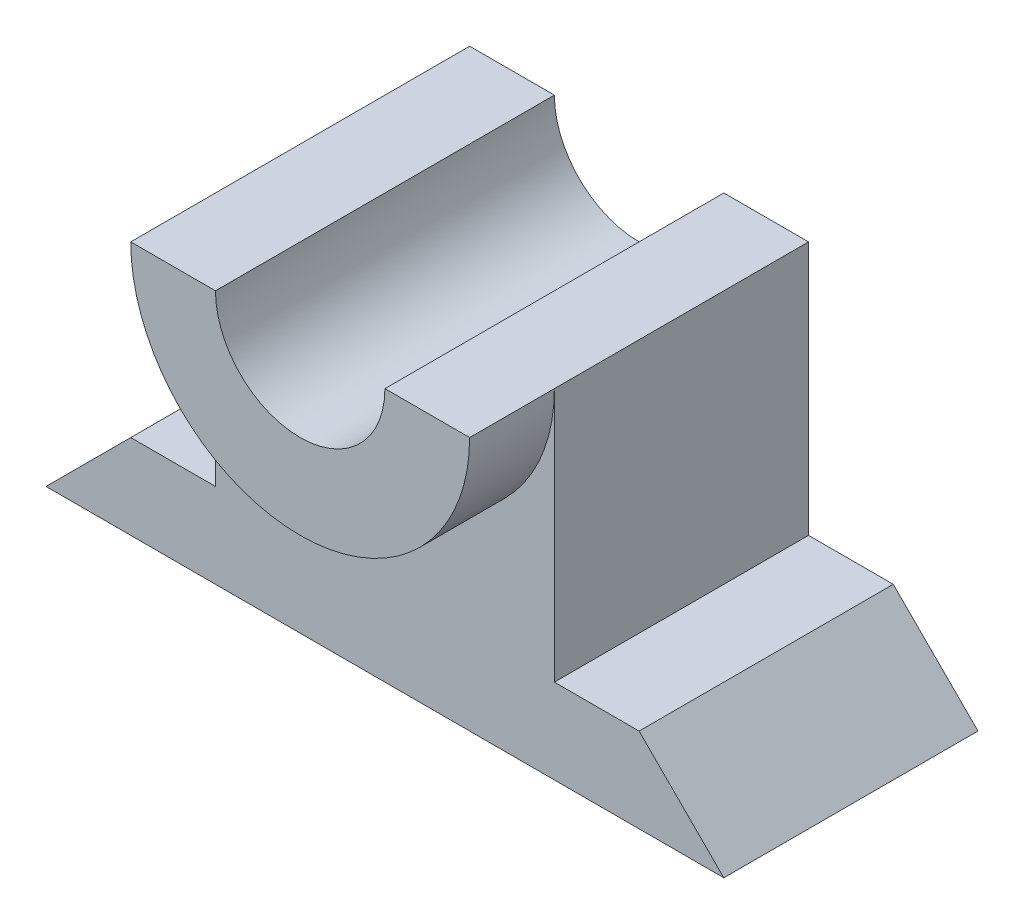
ISO-10303-21;
HEADER;
FILE_DESCRIPTION(('STEP AP214'),'2;1');
FILE_NAME('part.step','',(''),(''),'','','');
FILE_SCHEMA(('AUTOMOTIVE_DESIGN { 1 0 10303 214 1 1 1 1 }'));
ENDSEC;
DATA;
#1=APPLICATION_CONTEXT('core data for automotive mechanical design processes');
#2=APPLICATION_PROTOCOL_DEFINITION('international standard','automotive_design',2000,#1);
#3=PRODUCT_CONTEXT('',#1,'mechanical');
#4=PRODUCT('Part','Part','',(#3));
#5=PRODUCT_RELATED_PRODUCT_CATEGORY('part','',(#4));
#6=PRODUCT_DEFINITION_FORMATION('','',#4);
#7=PRODUCT_DEFINITION_CONTEXT('part definition',#1,'design');
#8=PRODUCT_DEFINITION('design','',#6,#7);
#9=PRODUCT_DEFINITION_SHAPE('','',#8);
#10=(LENGTH_UNIT() NAMED_UNIT(*) SI_UNIT(.MILLI.,.METRE.));
#11=(NAMED_UNIT(*) PLANE_ANGLE_UNIT() SI_UNIT($,.RADIAN.));
#12=(NAMED_UNIT(*) SI_UNIT($,.STERADIAN.) SOLID_ANGLE_UNIT());
#13=UNCERTAINTY_MEASURE_WITH_UNIT(LENGTH_MEASURE(1.E-05),#10,'distance_accuracy_value','');
#14=(GEOMETRIC_REPRESENTATION_CONTEXT(3) GLOBAL_UNCERTAINTY_ASSIGNED_CONTEXT((#13)) GLOBAL_UNIT_ASSIGNED_CONTEXT((#10,
#11,#12)) REPRESENTATION_CONTEXT('',''));
#15=CARTESIAN_POINT('',(0.,0.,0.));
#16=DIRECTION('',(0.,0.,1.));
#17=DIRECTION('',(1.,0.,0.));
#18=AXIS2_PLACEMENT_3D('',#15,#16,#17);
#19=CARTESIAN_POINT('',(-2.04903555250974,-68.0970044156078,30.));
#20=DIRECTION('',(0.,0.,1.));
#21=DIRECTION('',(1.,0.,0.));
#22=AXIS2_PLACEMENT_3D('',#19,#20,#21);
#23=PLANE('',#22);
#24=DIRECTION('',(0.,1.,0.));
#25=VECTOR('',#24,1.);
#26=CARTESIAN_POINT('',(20.,-68.0970044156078,30.));
#27=LINE('',#26,#25);
#28=CARTESIAN_POINT('',(20.,9.99999999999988,30.));
#29=VERTEX_POINT('',#28);
#30=CARTESIAN_POINT('',(20.,40.,30.));
#31=VERTEX_POINT('',#30);
#32=EDGE_CURVE('E96',#29,#31,#27,.T.);
#33=ORIENTED_EDGE('',*,*,#32,.T.);
#34=CARTESIAN_POINT('',(0.,40.,30.));
#35=DIRECTION('',(0.,0.,1.));
#36=DIRECTION('',(1.,0.,0.));
#37=AXIS2_PLACEMENT_3D('',#34,#35,#36);
#38=CIRCLE('',#37,20.);
#39=CARTESIAN_POINT('',(-20.,40.,30.));
#40=VERTEX_POINT('',#39);
#41=EDGE_CURVE('E142',#31,#40,#38,.F.);
#42=ORIENTED_EDGE('',*,*,#41,.T.);
#43=DIRECTION('',(0.,1.,0.));
#44=VECTOR('',#43,1.);
#45=CARTESIAN_POINT('',(-20.,-68.0970044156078,30.));
#46=LINE('',#45,#44);
#47=CARTESIAN_POINT('',(-20.,9.99999999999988,30.));
#48=VERTEX_POINT('',#47);
#49=EDGE_CURVE('E219',#48,#40,#46,.T.);
#50=ORIENTED_EDGE('',*,*,#49,.F.);
#51=DIRECTION('',(1.,0.,0.));
#52=VECTOR('',#51,1.);
#53=CARTESIAN_POINT('',(-2.0490355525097,9.99999999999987,30.));
#54=LINE('',#53,#52);
#55=CARTESIAN_POINT('',(-30.,9.99999999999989,30.));
#56=VERTEX_POINT('',#55);
#57=EDGE_CURVE('E132',#56,#48,#54,.T.);
#58=ORIENTED_EDGE('',*,*,#57,.F.);
#59=DIRECTION('',(0.707106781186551,0.707106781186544,0.));
#60=VECTOR('',#59,1.);
#61=CARTESIAN_POINT('',(-55.0730199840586,-15.0730199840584,30.));
#62=LINE('',#61,#60);
#63=CARTESIAN_POINT('',(-40.,0.,30.));
#64=VERTEX_POINT('',#63);
#65=EDGE_CURVE('E130',#64,#56,#62,.T.);
#66=ORIENTED_EDGE('',*,*,#65,.F.);
#67=DIRECTION('',(-1.,0.,0.));
#68=VECTOR('',#67,1.);
#69=CARTESIAN_POINT('',(-2.04903555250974,0.,30.));
#70=LINE('',#69,#68);
#71=CARTESIAN_POINT('',(40.,0.,30.));
#72=VERTEX_POINT('',#71);
#73=EDGE_CURVE('E118',#72,#64,#70,.T.);
#74=ORIENTED_EDGE('',*,*,#73,.F.);
#75=DIRECTION('',(-0.707106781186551,0.707106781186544,0.));
#76=VECTOR('',#75,1.);
#77=CARTESIAN_POINT('',(53.0239844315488,-13.0239844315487,30.));
#78=LINE('',#77,#76);
#79=CARTESIAN_POINT('',(30.,9.99999999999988,30.));
#80=VERTEX_POINT('',#79);
#81=EDGE_CURVE('E124',#72,#80,#78,.T.);
#82=ORIENTED_EDGE('',*,*,#81,.T.);
#83=DIRECTION('',(-1.,0.,0.));
#84=VECTOR('',#83,1.);
#85=CARTESIAN_POINT('',(-2.04903555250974,9.99999999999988,30.));
#86=LINE('',#85,#84);
#87=EDGE_CURVE('E49',#80,#29,#86,.T.);
#88=ORIENTED_EDGE('',*,*,#87,.T.);
#89=EDGE_LOOP('',(#33,#42,#50,#58,#66,#74,#82,#88));
#90=FACE_BOUND('',#89,.T.);
#91=ADVANCED_FACE('F32',(#90),#23,.T.);
#92=CARTESIAN_POINT('',(20.,-68.0970044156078,30.));
#93=DIRECTION('',(-1.,0.,0.));
#94=DIRECTION('',(0.,0.,1.));
#95=AXIS2_PLACEMENT_3D('',#92,#93,#94);
#96=PLANE('',#95);
#97=DIRECTION('',(0.,1.,0.));
#98=VECTOR('',#97,1.);
#99=CARTESIAN_POINT('',(20.,-68.0970044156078,0.));
#100=LINE('',#99,#98);
#101=CARTESIAN_POINT('',(20.,9.99999999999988,0.));
#102=VERTEX_POINT('',#101);
#103=CARTESIAN_POINT('',(20.,40.,0.));
#104=VERTEX_POINT('',#103);
#105=EDGE_CURVE('E138',#102,#104,#100,.T.);
#106=ORIENTED_EDGE('',*,*,#105,.T.);
#107=DIRECTION('',(0.,0.,-1.));
#108=VECTOR('',#107,1.);
#109=CARTESIAN_POINT('',(20.,40.,30.));
#110=LINE('',#109,#108);
#111=EDGE_CURVE('E11',#31,#104,#110,.T.);
#112=ORIENTED_EDGE('',*,*,#111,.F.);
#113=ORIENTED_EDGE('',*,*,#32,.F.);
#114=DIRECTION('',(0.,0.,-1.));
#115=VECTOR('',#114,1.);
#116=CARTESIAN_POINT('',(20.,9.99999999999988,30.));
#117=LINE('',#116,#115);
#118=EDGE_CURVE('E137',#29,#102,#117,.T.);
#119=ORIENTED_EDGE('',*,*,#118,.T.);
#120=EDGE_LOOP('',(#106,#112,#113,#119));
#121=FACE_BOUND('',#120,.T.);
#122=ADVANCED_FACE('F34',(#121),#96,.F.);
#123=CARTESIAN_POINT('',(-2.04903555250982,40.,30.));
#124=DIRECTION('',(0.,-1.,0.));
#125=DIRECTION('',(1.,0.,0.));
#126=AXIS2_PLACEMENT_3D('',#123,#124,#125);
#127=PLANE('',#126);
#128=DIRECTION('',(-1.,0.,0.));
#129=VECTOR('',#128,1.);
#130=CARTESIAN_POINT('',(-2.04903555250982,40.,0.));
#131=LINE('',#130,#129);
#132=CARTESIAN_POINT('',(10.,40.,0.));
#133=VERTEX_POINT('',#132);
#134=EDGE_CURVE('E141',#104,#133,#131,.T.);
#135=ORIENTED_EDGE('',*,*,#134,.T.);
#136=DIRECTION('',(0.,0.,-1.));
#137=VECTOR('',#136,1.);
#138=CARTESIAN_POINT('',(10.,40.,30.));
#139=LINE('',#138,#137);
#140=CARTESIAN_POINT('',(10.,40.,40.));
#141=VERTEX_POINT('',#140);
#142=EDGE_CURVE('E41',#141,#133,#139,.T.);
#143=ORIENTED_EDGE('',*,*,#142,.F.);
#144=DIRECTION('',(-1.,0.,0.));
#145=VECTOR('',#144,1.);
#146=CARTESIAN_POINT('',(-2.04903555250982,40.,40.));
#147=LINE('',#146,#145);
#148=CARTESIAN_POINT('',(20.,40.,40.));
#149=VERTEX_POINT('',#148);
#150=EDGE_CURVE('E205',#149,#141,#147,.T.);
#151=ORIENTED_EDGE('',*,*,#150,.F.);
#152=DIRECTION('',(0.,0.,-1.));
#153=VECTOR('',#152,1.);
#154=CARTESIAN_POINT('',(20.,40.,40.));
#155=LINE('',#154,#153);
#156=EDGE_CURVE('E212',#149,#31,#155,.T.);
#157=ORIENTED_EDGE('',*,*,#156,.T.);
#158=ORIENTED_EDGE('',*,*,#111,.T.);
#159=EDGE_LOOP('',(#135,#143,#151,#157,#158));
#160=FACE_BOUND('',#159,.T.);
#161=ADVANCED_FACE('F184',(#160),#127,.F.);
#162=CARTESIAN_POINT('',(0.,40.,30.));
#163=DIRECTION('',(0.,0.,-1.));
#164=DIRECTION('',(-1.,0.,0.));
#165=AXIS2_PLACEMENT_3D('',#162,#163,#164);
#166=CYLINDRICAL_SURFACE('',#165,10.);
#167=CARTESIAN_POINT('',(0.,40.,0.));
#168=DIRECTION('',(0.,0.,1.));
#169=DIRECTION('',(1.,0.,0.));
#170=AXIS2_PLACEMENT_3D('',#167,#168,#169);
#171=CIRCLE('',#170,10.);
#172=CARTESIAN_POINT('',(-10.,40.,0.));
#173=VERTEX_POINT('',#172);
#174=EDGE_CURVE('E145',#173,#133,#171,.T.);
#175=ORIENTED_EDGE('',*,*,#174,.F.);
#176=DIRECTION('',(0.,0.,-1.));
#177=VECTOR('',#176,1.);
#178=CARTESIAN_POINT('',(-10.,40.,30.));
#179=LINE('',#178,#177);
#180=CARTESIAN_POINT('',(-10.,40.,40.));
#181=VERTEX_POINT('',#180);
#182=EDGE_CURVE('E172',#181,#173,#179,.T.);
#183=ORIENTED_EDGE('',*,*,#182,.F.);
#184=CARTESIAN_POINT('',(0.,40.,40.));
#185=DIRECTION('',(0.,0.,1.));
#186=DIRECTION('',(1.,0.,0.));
#187=AXIS2_PLACEMENT_3D('',#184,#185,#186);
#188=CIRCLE('',#187,10.);
#189=EDGE_CURVE('E180',#181,#141,#188,.T.);
#190=ORIENTED_EDGE('',*,*,#189,.T.);
#191=ORIENTED_EDGE('',*,*,#142,.T.);
#192=EDGE_LOOP('',(#175,#183,#190,#191));
#193=FACE_BOUND('',#192,.T.);
#194=ADVANCED_FACE('F177',(#193),#166,.F.);
#195=CARTESIAN_POINT('',(-2.04903555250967,40.,30.));
#196=DIRECTION('',(0.,1.,0.));
#197=DIRECTION('',(-1.,0.,0.));
#198=AXIS2_PLACEMENT_3D('',#195,#196,#197);
#199=PLANE('',#198);
#200=DIRECTION('',(1.,0.,0.));
#201=VECTOR('',#200,1.);
#202=CARTESIAN_POINT('',(-2.04903555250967,40.,0.));
#203=LINE('',#202,#201);
#204=CARTESIAN_POINT('',(-20.,40.,0.));
#205=VERTEX_POINT('',#204);
#206=EDGE_CURVE('E148',#205,#173,#203,.T.);
#207=ORIENTED_EDGE('',*,*,#206,.F.);
#208=DIRECTION('',(0.,0.,-1.));
#209=VECTOR('',#208,1.);
#210=CARTESIAN_POINT('',(-20.,40.,30.));
#211=LINE('',#210,#209);
#212=EDGE_CURVE('E170',#40,#205,#211,.T.);
#213=ORIENTED_EDGE('',*,*,#212,.F.);
#214=DIRECTION('',(0.,0.,-1.));
#215=VECTOR('',#214,1.);
#216=CARTESIAN_POINT('',(-20.,40.,40.));
#217=LINE('',#216,#215);
#218=CARTESIAN_POINT('',(-20.,40.,40.));
#219=VERTEX_POINT('',#218);
#220=EDGE_CURVE('E214',#219,#40,#217,.T.);
#221=ORIENTED_EDGE('',*,*,#220,.F.);
#222=DIRECTION('',(1.,0.,0.));
#223=VECTOR('',#222,1.);
#224=CARTESIAN_POINT('',(-2.04903555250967,40.,40.));
#225=LINE('',#224,#223);
#226=EDGE_CURVE('E199',#219,#181,#225,.T.);
#227=ORIENTED_EDGE('',*,*,#226,.T.);
#228=ORIENTED_EDGE('',*,*,#182,.T.);
#229=EDGE_LOOP('',(#207,#213,#221,#227,#228));
#230=FACE_BOUND('',#229,.T.);
#231=ADVANCED_FACE('F193',(#230),#199,.T.);
#232=CARTESIAN_POINT('',(-20.,-68.0970044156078,30.));
#233=DIRECTION('',(-1.,0.,0.));
#234=DIRECTION('',(0.,0.,1.));
#235=AXIS2_PLACEMENT_3D('',#232,#233,#234);
#236=PLANE('',#235);
#237=DIRECTION('',(0.,1.,0.));
#238=VECTOR('',#237,1.);
#239=CARTESIAN_POINT('',(-20.,-68.0970044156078,0.));
#240=LINE('',#239,#238);
#241=CARTESIAN_POINT('',(-20.,9.99999999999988,0.));
#242=VERTEX_POINT('',#241);
#243=EDGE_CURVE('E151',#242,#205,#240,.T.);
#244=ORIENTED_EDGE('',*,*,#243,.F.);
#245=DIRECTION('',(0.,0.,-1.));
#246=VECTOR('',#245,1.);
#247=CARTESIAN_POINT('',(-20.,9.99999999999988,30.));
#248=LINE('',#247,#246);
#249=EDGE_CURVE('E168',#48,#242,#248,.T.);
#250=ORIENTED_EDGE('',*,*,#249,.F.);
#251=ORIENTED_EDGE('',*,*,#49,.T.);
#252=ORIENTED_EDGE('',*,*,#212,.T.);
#253=EDGE_LOOP('',(#244,#250,#251,#252));
#254=FACE_BOUND('',#253,.T.);
#255=ADVANCED_FACE('F267',(#254),#236,.T.);
#256=CARTESIAN_POINT('',(-2.0490355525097,9.99999999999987,30.));
#257=DIRECTION('',(0.,1.,0.));
#258=DIRECTION('',(-1.,0.,0.));
#259=AXIS2_PLACEMENT_3D('',#256,#257,#258);
#260=PLANE('',#259);
#261=DIRECTION('',(1.,0.,0.));
#262=VECTOR('',#261,1.);
#263=CARTESIAN_POINT('',(-2.0490355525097,9.99999999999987,0.));
#264=LINE('',#263,#262);
#265=CARTESIAN_POINT('',(-30.,9.99999999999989,0.));
#266=VERTEX_POINT('',#265);
#267=EDGE_CURVE('E154',#266,#242,#264,.T.);
#268=ORIENTED_EDGE('',*,*,#267,.F.);
#269=DIRECTION('',(0.,0.,-1.));
#270=VECTOR('',#269,1.);
#271=CARTESIAN_POINT('',(-30.,9.99999999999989,30.));
#272=LINE('',#271,#270);
#273=EDGE_CURVE('E166',#56,#266,#272,.T.);
#274=ORIENTED_EDGE('',*,*,#273,.F.);
#275=ORIENTED_EDGE('',*,*,#57,.T.);
#276=ORIENTED_EDGE('',*,*,#249,.T.);
#277=EDGE_LOOP('',(#268,#274,#275,#276));
#278=FACE_BOUND('',#277,.T.);
#279=ADVANCED_FACE('F223',(#278),#260,.T.);
#280=CARTESIAN_POINT('',(-55.0730199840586,-15.0730199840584,30.));
#281=DIRECTION('',(-0.707106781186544,0.707106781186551,0.));
#282=DIRECTION('',(-0.707106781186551,-0.707106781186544,0.));
#283=AXIS2_PLACEMENT_3D('',#280,#281,#282);
#284=PLANE('',#283);
#285=DIRECTION('',(0.707106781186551,0.707106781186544,0.));
#286=VECTOR('',#285,1.);
#287=CARTESIAN_POINT('',(-55.0730199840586,-15.0730199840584,0.));
#288=LINE('',#287,#286);
#289=CARTESIAN_POINT('',(-40.,0.,0.));
#290=VERTEX_POINT('',#289);
#291=EDGE_CURVE('E157',#290,#266,#288,.T.);
#292=ORIENTED_EDGE('',*,*,#291,.F.);
#293=DIRECTION('',(0.,0.,-1.));
#294=VECTOR('',#293,1.);
#295=CARTESIAN_POINT('',(-40.,0.,30.));
#296=LINE('',#295,#294);
#297=EDGE_CURVE('E121',#64,#290,#296,.T.);
#298=ORIENTED_EDGE('',*,*,#297,.F.);
#299=ORIENTED_EDGE('',*,*,#65,.T.);
#300=ORIENTED_EDGE('',*,*,#273,.T.);
#301=EDGE_LOOP('',(#292,#298,#299,#300));
#302=FACE_BOUND('',#301,.T.);
#303=ADVANCED_FACE('F227',(#302),#284,.T.);
#304=CARTESIAN_POINT('',(-2.04903555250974,0.,30.));
#305=DIRECTION('',(0.,-1.,0.));
#306=DIRECTION('',(0.,0.,-1.));
#307=AXIS2_PLACEMENT_3D('',#304,#305,#306);
#308=PLANE('',#307);
#309=DIRECTION('',(-1.,0.,0.));
#310=VECTOR('',#309,1.);
#311=CARTESIAN_POINT('',(-2.04903555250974,0.,0.));
#312=LINE('',#311,#310);
#313=CARTESIAN_POINT('',(40.,0.,0.));
#314=VERTEX_POINT('',#313);
#315=EDGE_CURVE('E120',#314,#290,#312,.T.);
#316=ORIENTED_EDGE('',*,*,#315,.F.);
#317=DIRECTION('',(0.,0.,-1.));
#318=VECTOR('',#317,1.);
#319=CARTESIAN_POINT('',(40.,0.,30.));
#320=LINE('',#319,#318);
#321=EDGE_CURVE('E114',#72,#314,#320,.T.);
#322=ORIENTED_EDGE('',*,*,#321,.F.);
#323=ORIENTED_EDGE('',*,*,#73,.T.);
#324=ORIENTED_EDGE('',*,*,#297,.T.);
#325=EDGE_LOOP('',(#316,#322,#323,#324));
#326=FACE_BOUND('',#325,.T.);
#327=ADVANCED_FACE('F116',(#326),#308,.T.);
#328=CARTESIAN_POINT('',(53.0239844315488,-13.0239844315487,30.));
#329=DIRECTION('',(-0.707106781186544,-0.707106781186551,0.));
#330=DIRECTION('',(0.707106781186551,-0.707106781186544,0.));
#331=AXIS2_PLACEMENT_3D('',#328,#329,#330);
#332=PLANE('',#331);
#333=DIRECTION('',(-0.707106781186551,0.707106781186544,0.));
#334=VECTOR('',#333,1.);
#335=CARTESIAN_POINT('',(53.0239844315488,-13.0239844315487,0.));
#336=LINE('',#335,#334);
#337=CARTESIAN_POINT('',(30.,9.99999999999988,0.));
#338=VERTEX_POINT('',#337);
#339=EDGE_CURVE('E84',#314,#338,#336,.T.);
#340=ORIENTED_EDGE('',*,*,#339,.T.);
#341=DIRECTION('',(0.,0.,-1.));
#342=VECTOR('',#341,1.);
#343=CARTESIAN_POINT('',(30.,9.99999999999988,30.));
#344=LINE('',#343,#342);
#345=EDGE_CURVE('E122',#80,#338,#344,.T.);
#346=ORIENTED_EDGE('',*,*,#345,.F.);
#347=ORIENTED_EDGE('',*,*,#81,.F.);
#348=ORIENTED_EDGE('',*,*,#321,.T.);
#349=EDGE_LOOP('',(#340,#346,#347,#348));
#350=FACE_BOUND('',#349,.T.);
#351=ADVANCED_FACE('F125',(#350),#332,.F.);
#352=CARTESIAN_POINT('',(-2.04903555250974,9.99999999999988,30.));
#353=DIRECTION('',(0.,-1.,0.));
#354=DIRECTION('',(0.,0.,-1.));
#355=AXIS2_PLACEMENT_3D('',#352,#353,#354);
#356=PLANE('',#355);
#357=DIRECTION('',(-1.,0.,0.));
#358=VECTOR('',#357,1.);
#359=CARTESIAN_POINT('',(-2.04903555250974,9.99999999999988,0.));
#360=LINE('',#359,#358);
#361=EDGE_CURVE('E90',#338,#102,#360,.T.);
#362=ORIENTED_EDGE('',*,*,#361,.T.);
#363=ORIENTED_EDGE('',*,*,#118,.F.);
#364=ORIENTED_EDGE('',*,*,#87,.F.);
#365=ORIENTED_EDGE('',*,*,#345,.T.);
#366=EDGE_LOOP('',(#362,#363,#364,#365));
#367=FACE_BOUND('',#366,.T.);
#368=ADVANCED_FACE('F230',(#367),#356,.F.);
#369=CARTESIAN_POINT('',(-2.04903555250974,-68.0970044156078,0.));
#370=DIRECTION('',(0.,0.,1.));
#371=DIRECTION('',(1.,0.,0.));
#372=AXIS2_PLACEMENT_3D('',#369,#370,#371);
#373=PLANE('',#372);
#374=ORIENTED_EDGE('',*,*,#134,.F.);
#375=ORIENTED_EDGE('',*,*,#105,.F.);
#376=ORIENTED_EDGE('',*,*,#361,.F.);
#377=ORIENTED_EDGE('',*,*,#339,.F.);
#378=ORIENTED_EDGE('',*,*,#315,.T.);
#379=ORIENTED_EDGE('',*,*,#291,.T.);
#380=ORIENTED_EDGE('',*,*,#267,.T.);
#381=ORIENTED_EDGE('',*,*,#243,.T.);
#382=ORIENTED_EDGE('',*,*,#206,.T.);
#383=ORIENTED_EDGE('',*,*,#174,.T.);
#384=EDGE_LOOP('',(#374,#375,#376,#377,#378,#379,#380,#381,#382,#383));
#385=FACE_BOUND('',#384,.T.);
#386=ADVANCED_FACE('F188',(#385),#373,.F.);
#387=CARTESIAN_POINT('',(0.,40.,40.));
#388=DIRECTION('',(0.,0.,-1.));
#389=DIRECTION('',(-1.,0.,0.));
#390=AXIS2_PLACEMENT_3D('',#387,#388,#389);
#391=CYLINDRICAL_SURFACE('',#390,20.);
#392=ORIENTED_EDGE('',*,*,#41,.F.);
#393=ORIENTED_EDGE('',*,*,#156,.F.);
#394=CARTESIAN_POINT('',(0.,40.,40.));
#395=DIRECTION('',(0.,0.,1.));
#396=DIRECTION('',(1.,0.,0.));
#397=AXIS2_PLACEMENT_3D('',#394,#395,#396);
#398=CIRCLE('',#397,20.);
#399=EDGE_CURVE('E207',#219,#149,#398,.T.);
#400=ORIENTED_EDGE('',*,*,#399,.F.);
#401=ORIENTED_EDGE('',*,*,#220,.T.);
#402=EDGE_LOOP('',(#392,#393,#400,#401));
#403=FACE_BOUND('',#402,.T.);
#404=ADVANCED_FACE('F237',(#403),#391,.T.);
#405=CARTESIAN_POINT('',(-2.04903555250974,-68.0970044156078,40.));
#406=DIRECTION('',(0.,0.,1.));
#407=DIRECTION('',(1.,0.,0.));
#408=AXIS2_PLACEMENT_3D('',#405,#406,#407);
#409=PLANE('',#408);
#410=ORIENTED_EDGE('',*,*,#189,.F.);
#411=ORIENTED_EDGE('',*,*,#226,.F.);
#412=ORIENTED_EDGE('',*,*,#399,.T.);
#413=ORIENTED_EDGE('',*,*,#150,.T.);
#414=EDGE_LOOP('',(#410,#411,#412,#413));
#415=FACE_BOUND('',#414,.T.);
#416=ADVANCED_FACE('F203',(#415),#409,.T.);
#417=CLOSED_SHELL('',(#91,#122,#161,#194,#231,#255,#279,#303,#327,#351,#368,#386,#404,#416));
#418=MANIFOLD_SOLID_BREP('B2',#417);
#419=ADVANCED_BREP_SHAPE_REPRESENTATION('',(#18,#418),#14);
#420=SHAPE_DEFINITION_REPRESENTATION(#9,#419);
ENDSEC;
END-ISO-10303-21;
